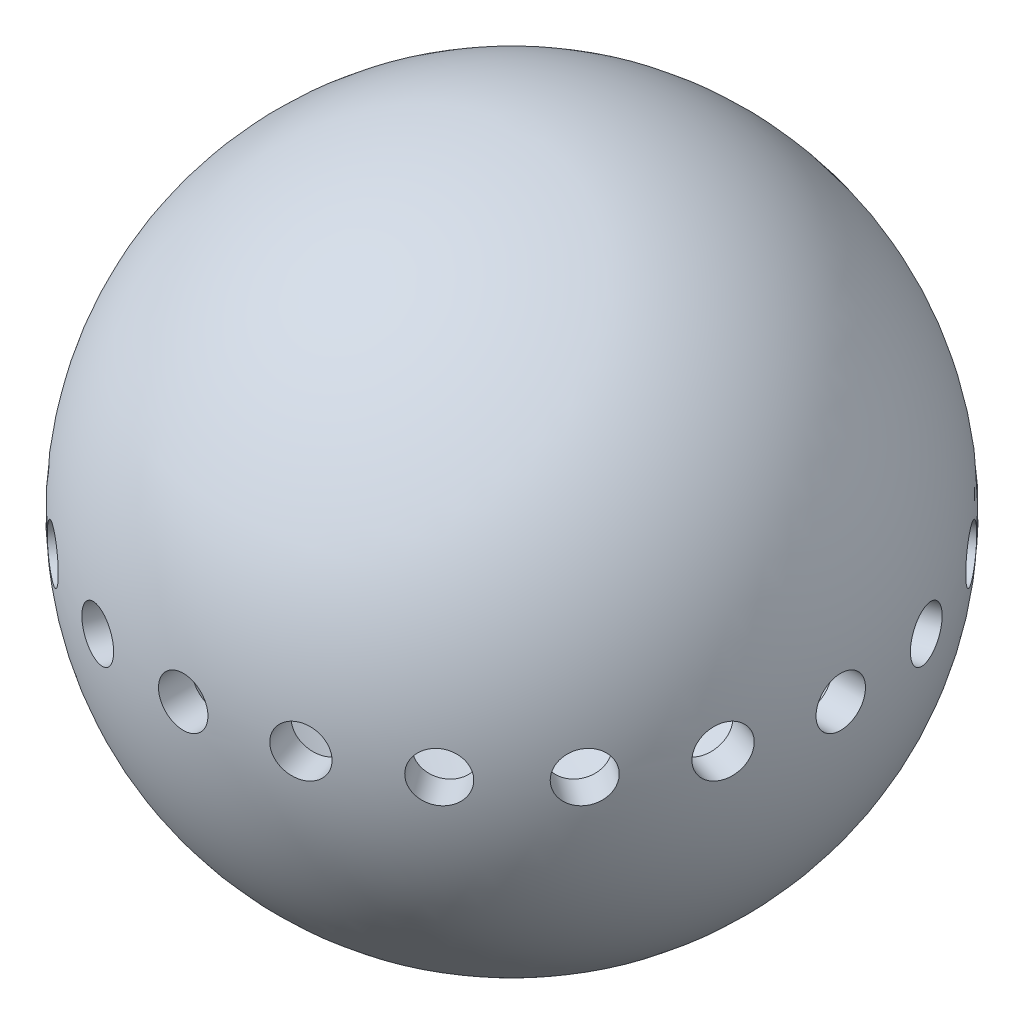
ISO-10303-21;
HEADER;
FILE_DESCRIPTION(('STEP AP214'),'2;1');
FILE_NAME('part.step','',(''),(''),'','','');
FILE_SCHEMA(('AUTOMOTIVE_DESIGN { 1 0 10303 214 1 1 1 1 }'));
ENDSEC;
DATA;
#1=APPLICATION_CONTEXT('core data for automotive mechanical design processes');
#2=APPLICATION_PROTOCOL_DEFINITION('international standard','automotive_design',2000,#1);
#3=PRODUCT_CONTEXT('',#1,'mechanical');
#4=PRODUCT('Part','Part','',(#3));
#5=PRODUCT_RELATED_PRODUCT_CATEGORY('part','',(#4));
#6=PRODUCT_DEFINITION_FORMATION('','',#4);
#7=PRODUCT_DEFINITION_CONTEXT('part definition',#1,'design');
#8=PRODUCT_DEFINITION('design','',#6,#7);
#9=PRODUCT_DEFINITION_SHAPE('','',#8);
#10=(LENGTH_UNIT() NAMED_UNIT(*) SI_UNIT(.MILLI.,.METRE.));
#11=(NAMED_UNIT(*) PLANE_ANGLE_UNIT() SI_UNIT($,.RADIAN.));
#12=(NAMED_UNIT(*) SI_UNIT($,.STERADIAN.) SOLID_ANGLE_UNIT());
#13=UNCERTAINTY_MEASURE_WITH_UNIT(LENGTH_MEASURE(1.E-05),#10,'distance_accuracy_value','');
#14=(GEOMETRIC_REPRESENTATION_CONTEXT(3) GLOBAL_UNCERTAINTY_ASSIGNED_CONTEXT((#13)) GLOBAL_UNIT_ASSIGNED_CONTEXT((#10,
#11,#12)) REPRESENTATION_CONTEXT('',''));
#15=CARTESIAN_POINT('',(0.,0.,0.));
#16=DIRECTION('',(0.,0.,1.));
#17=DIRECTION('',(1.,0.,0.));
#18=AXIS2_PLACEMENT_3D('',#15,#16,#17);
#19=CARTESIAN_POINT('',(0.,0.,0.));
#20=DIRECTION('',(0.,1.,0.));
#21=DIRECTION('',(-1.,0.,0.));
#22=AXIS2_PLACEMENT_3D('',#19,#20,#21);
#23=SPHERICAL_SURFACE('',#22,18.);
#24=CARTESIAN_POINT('',(0.,0.,17.9373911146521));
#25=DIRECTION('',(0.,0.,-1.));
#26=DIRECTION('',(-1.,0.,0.));
#27=AXIS2_PLACEMENT_3D('',#24,#25,#26);
#28=CIRCLE('',#27,1.5);
#29=CARTESIAN_POINT('',(-1.5,0.,17.9373911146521));
#30=VERTEX_POINT('',#29);
#31=EDGE_CURVE('E38',#30,#30,#28,.T.);
#32=ORIENTED_EDGE('',*,*,#31,.F.);
#33=EDGE_LOOP('',(#32));
#34=FACE_BOUND('',#33,.T.);
#35=CARTESIAN_POINT('',(-5.54295868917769,0.,17.0594727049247));
#36=DIRECTION('',(0.309016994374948,0.,-0.951056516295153));
#37=DIRECTION('',(-0.951056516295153,0.,-0.309016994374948));
#38=AXIS2_PLACEMENT_3D('',#35,#36,#37);
#39=CIRCLE('',#38,1.5);
#40=CARTESIAN_POINT('',(-6.96954346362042,0.,16.5959472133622));
#41=VERTEX_POINT('',#40);
#42=EDGE_CURVE('E51',#41,#41,#39,.T.);
#43=ORIENTED_EDGE('',*,*,#42,.F.);
#44=EDGE_LOOP('',(#43));
#45=FACE_BOUND('',#44,.T.);
#46=CARTESIAN_POINT('',(10.5433339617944,0.,14.5116542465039));
#47=DIRECTION('',(-0.587785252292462,0.,-0.809016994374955));
#48=DIRECTION('',(-0.809016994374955,0.,0.587785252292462));
#49=AXIS2_PLACEMENT_3D('',#46,#47,#48);
#50=CIRCLE('',#49,1.5);
#51=CARTESIAN_POINT('',(9.32980847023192,0.,15.3933321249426));
#52=VERTEX_POINT('',#51);
#53=EDGE_CURVE('E55',#52,#52,#50,.T.);
#54=ORIENTED_EDGE('',*,*,#53,.F.);
#55=EDGE_LOOP('',(#54));
#56=FACE_BOUND('',#55,.T.);
#57=CARTESIAN_POINT('',(5.54295868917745,0.,17.0594727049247));
#58=DIRECTION('',(-0.309016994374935,0.,-0.951056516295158));
#59=DIRECTION('',(-0.951056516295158,0.,0.309016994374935));
#60=AXIS2_PLACEMENT_3D('',#57,#58,#59);
#61=CIRCLE('',#60,1.5);
#62=CARTESIAN_POINT('',(4.11637391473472,0.,17.5229981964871));
#63=VERTEX_POINT('',#62);
#64=EDGE_CURVE('E59',#63,#63,#61,.T.);
#65=ORIENTED_EDGE('',*,*,#64,.F.);
#66=EDGE_LOOP('',(#65));
#67=FACE_BOUND('',#66,.T.);
#68=CARTESIAN_POINT('',(10.5433339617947,0.,-14.5116542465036));
#69=DIRECTION('',(-0.58778525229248,0.,0.809016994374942));
#70=DIRECTION('',(0.809016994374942,0.,0.58778525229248));
#71=AXIS2_PLACEMENT_3D('',#68,#69,#70);
#72=CIRCLE('',#71,1.5);
#73=CARTESIAN_POINT('',(11.7568594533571,0.,-13.6299763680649));
#74=VERTEX_POINT('',#73);
#75=EDGE_CURVE('E63',#74,#74,#72,.T.);
#76=ORIENTED_EDGE('',*,*,#75,.F.);
#77=EDGE_LOOP('',(#76));
#78=FACE_BOUND('',#77,.T.);
#79=CARTESIAN_POINT('',(14.5116542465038,0.,-10.5433339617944));
#80=DIRECTION('',(-0.809016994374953,0.,0.587785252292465));
#81=DIRECTION('',(0.587785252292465,0.,0.809016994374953));
#82=AXIS2_PLACEMENT_3D('',#79,#80,#81);
#83=CIRCLE('',#82,1.5);
#84=CARTESIAN_POINT('',(15.3933321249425,0.,-9.32980847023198));
#85=VERTEX_POINT('',#84);
#86=EDGE_CURVE('E67',#85,#85,#83,.T.);
#87=ORIENTED_EDGE('',*,*,#86,.F.);
#88=EDGE_LOOP('',(#87));
#89=FACE_BOUND('',#88,.T.);
#90=CARTESIAN_POINT('',(5.54295868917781,0.,-17.0594727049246));
#91=DIRECTION('',(-0.309016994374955,0.,0.951056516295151));
#92=DIRECTION('',(0.951056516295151,0.,0.309016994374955));
#93=AXIS2_PLACEMENT_3D('',#90,#91,#92);
#94=CIRCLE('',#93,1.5);
#95=CARTESIAN_POINT('',(6.96954346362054,0.,-16.5959472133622));
#96=VERTEX_POINT('',#95);
#97=EDGE_CURVE('E71',#96,#96,#94,.T.);
#98=ORIENTED_EDGE('',*,*,#97,.F.);
#99=EDGE_LOOP('',(#98));
#100=FACE_BOUND('',#99,.T.);
#101=CARTESIAN_POINT('',(0.,0.,-17.9373911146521));
#102=DIRECTION('',(0.,0.,1.));
#103=DIRECTION('',(1.,0.,0.));
#104=AXIS2_PLACEMENT_3D('',#101,#102,#103);
#105=CIRCLE('',#104,1.5);
#106=CARTESIAN_POINT('',(1.5,0.,-17.9373911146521));
#107=VERTEX_POINT('',#106);
#108=EDGE_CURVE('E75',#107,#107,#105,.T.);
#109=ORIENTED_EDGE('',*,*,#108,.F.);
#110=EDGE_LOOP('',(#109));
#111=FACE_BOUND('',#110,.T.);
#112=CARTESIAN_POINT('',(17.0594727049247,0.,-5.54295868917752));
#113=DIRECTION('',(-0.951056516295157,0.,0.309016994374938));
#114=DIRECTION('',(0.309016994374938,0.,0.951056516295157));
#115=AXIS2_PLACEMENT_3D('',#112,#113,#114);
#116=CIRCLE('',#115,1.5);
#117=CARTESIAN_POINT('',(17.5229981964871,0.,-4.11637391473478));
#118=VERTEX_POINT('',#117);
#119=EDGE_CURVE('E79',#118,#118,#116,.T.);
#120=ORIENTED_EDGE('',*,*,#119,.F.);
#121=EDGE_LOOP('',(#120));
#122=FACE_BOUND('',#121,.T.);
#123=CARTESIAN_POINT('',(17.9373911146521,0.,1.87884199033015E-13));
#124=DIRECTION('',(-1.,0.,0.));
#125=DIRECTION('',(0.,0.,1.));
#126=AXIS2_PLACEMENT_3D('',#123,#124,#125);
#127=CIRCLE('',#126,1.5);
#128=CARTESIAN_POINT('',(17.9373911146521,0.,1.50000000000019));
#129=VERTEX_POINT('',#128);
#130=EDGE_CURVE('E83',#129,#129,#127,.T.);
#131=ORIENTED_EDGE('',*,*,#130,.F.);
#132=EDGE_LOOP('',(#131));
#133=FACE_BOUND('',#132,.T.);
#134=CARTESIAN_POINT('',(14.5116542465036,0.,10.5433339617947));
#135=DIRECTION('',(-0.80901699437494,0.,-0.587785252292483));
#136=DIRECTION('',(-0.587785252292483,0.,0.80901699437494));
#137=AXIS2_PLACEMENT_3D('',#134,#135,#136);
#138=CIRCLE('',#137,1.5);
#139=CARTESIAN_POINT('',(13.6299763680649,0.,11.7568594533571));
#140=VERTEX_POINT('',#139);
#141=EDGE_CURVE('E87',#140,#140,#138,.T.);
#142=ORIENTED_EDGE('',*,*,#141,.F.);
#143=EDGE_LOOP('',(#142));
#144=FACE_BOUND('',#143,.T.);
#145=CARTESIAN_POINT('',(17.0594727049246,0.,5.54295868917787));
#146=DIRECTION('',(-0.95105651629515,0.,-0.309016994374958));
#147=DIRECTION('',(-0.309016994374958,0.,0.95105651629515));
#148=AXIS2_PLACEMENT_3D('',#145,#146,#147);
#149=CIRCLE('',#148,1.5);
#150=CARTESIAN_POINT('',(16.5959472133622,0.,6.9695434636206));
#151=VERTEX_POINT('',#150);
#152=EDGE_CURVE('E91',#151,#151,#149,.T.);
#153=ORIENTED_EDGE('',*,*,#152,.F.);
#154=EDGE_LOOP('',(#153));
#155=FACE_BOUND('',#154,.T.);
#156=CARTESIAN_POINT('',(-14.5116542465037,0.,-10.5433339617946));
#157=DIRECTION('',(0.809016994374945,0.,0.587785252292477));
#158=DIRECTION('',(0.587785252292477,0.,-0.809016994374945));
#159=AXIS2_PLACEMENT_3D('',#156,#157,#158);
#160=CIRCLE('',#159,1.5);
#161=CARTESIAN_POINT('',(-13.629976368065,0.,-11.756859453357));
#162=VERTEX_POINT('',#161);
#163=EDGE_CURVE('E95',#162,#162,#160,.T.);
#164=ORIENTED_EDGE('',*,*,#163,.F.);
#165=EDGE_LOOP('',(#164));
#166=FACE_BOUND('',#165,.T.);
#167=CARTESIAN_POINT('',(-17.0594727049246,0.,-5.54295868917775));
#168=DIRECTION('',(0.951056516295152,0.,0.309016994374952));
#169=DIRECTION('',(0.309016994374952,0.,-0.951056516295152));
#170=AXIS2_PLACEMENT_3D('',#167,#168,#169);
#171=CIRCLE('',#170,1.5);
#172=CARTESIAN_POINT('',(-16.5959472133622,0.,-6.96954346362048));
#173=VERTEX_POINT('',#172);
#174=EDGE_CURVE('E99',#173,#173,#171,.T.);
#175=ORIENTED_EDGE('',*,*,#174,.F.);
#176=EDGE_LOOP('',(#175));
#177=FACE_BOUND('',#176,.T.);
#178=CARTESIAN_POINT('',(-5.54295868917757,0.,-17.0594727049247));
#179=DIRECTION('',(0.309016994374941,0.,0.951056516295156));
#180=DIRECTION('',(0.951056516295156,0.,-0.309016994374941));
#181=AXIS2_PLACEMENT_3D('',#178,#179,#180);
#182=CIRCLE('',#181,1.5);
#183=CARTESIAN_POINT('',(-4.11637391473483,0.,-17.5229981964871));
#184=VERTEX_POINT('',#183);
#185=EDGE_CURVE('E103',#184,#184,#182,.T.);
#186=ORIENTED_EDGE('',*,*,#185,.F.);
#187=EDGE_LOOP('',(#186));
#188=FACE_BOUND('',#187,.T.);
#189=CARTESIAN_POINT('',(-10.5433339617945,0.,-14.5116542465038));
#190=DIRECTION('',(0.587785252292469,0.,0.809016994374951));
#191=DIRECTION('',(0.809016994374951,0.,-0.587785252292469));
#192=AXIS2_PLACEMENT_3D('',#189,#190,#191);
#193=CIRCLE('',#192,1.5);
#194=CARTESIAN_POINT('',(-9.32980847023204,0.,-15.3933321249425));
#195=VERTEX_POINT('',#194);
#196=EDGE_CURVE('E107',#195,#195,#193,.T.);
#197=ORIENTED_EDGE('',*,*,#196,.F.);
#198=EDGE_LOOP('',(#197));
#199=FACE_BOUND('',#198,.T.);
#200=CARTESIAN_POINT('',(-14.5116542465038,0.,10.5433339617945));
#201=DIRECTION('',(0.809016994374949,0.,-0.587785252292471));
#202=DIRECTION('',(-0.587785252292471,0.,-0.809016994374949));
#203=AXIS2_PLACEMENT_3D('',#200,#201,#202);
#204=CIRCLE('',#203,1.5);
#205=CARTESIAN_POINT('',(-15.3933321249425,0.,9.32980847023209));
#206=VERTEX_POINT('',#205);
#207=EDGE_CURVE('E111',#206,#206,#204,.T.);
#208=ORIENTED_EDGE('',*,*,#207,.F.);
#209=EDGE_LOOP('',(#208));
#210=FACE_BOUND('',#209,.T.);
#211=CARTESIAN_POINT('',(-10.5433339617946,0.,14.5116542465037));
#212=DIRECTION('',(0.587785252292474,0.,-0.809016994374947));
#213=DIRECTION('',(-0.809016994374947,0.,-0.587785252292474));
#214=AXIS2_PLACEMENT_3D('',#211,#212,#213);
#215=CIRCLE('',#214,1.5);
#216=CARTESIAN_POINT('',(-11.756859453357,0.,13.629976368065));
#217=VERTEX_POINT('',#216);
#218=EDGE_CURVE('E114',#217,#217,#215,.T.);
#219=ORIENTED_EDGE('',*,*,#218,.F.);
#220=EDGE_LOOP('',(#219));
#221=FACE_BOUND('',#220,.T.);
#222=CARTESIAN_POINT('',(-17.0594727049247,0.,5.54295868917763));
#223=DIRECTION('',(0.951056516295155,0.,-0.309016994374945));
#224=DIRECTION('',(-0.309016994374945,0.,-0.951056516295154));
#225=AXIS2_PLACEMENT_3D('',#222,#223,#224);
#226=CIRCLE('',#225,1.5);
#227=CARTESIAN_POINT('',(-17.5229981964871,0.,4.1163739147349));
#228=VERTEX_POINT('',#227);
#229=EDGE_CURVE('E117',#228,#228,#226,.T.);
#230=ORIENTED_EDGE('',*,*,#229,.F.);
#231=EDGE_LOOP('',(#230));
#232=FACE_BOUND('',#231,.T.);
#233=CARTESIAN_POINT('',(-17.9373911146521,0.,0.));
#234=DIRECTION('',(1.,0.,0.));
#235=DIRECTION('',(0.,0.,-1.));
#236=AXIS2_PLACEMENT_3D('',#233,#234,#235);
#237=CIRCLE('',#236,1.5);
#238=CARTESIAN_POINT('',(-17.9373911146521,0.,-1.50000000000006));
#239=VERTEX_POINT('',#238);
#240=EDGE_CURVE('E43',#239,#239,#237,.T.);
#241=ORIENTED_EDGE('',*,*,#240,.F.);
#242=EDGE_LOOP('',(#241));
#243=FACE_BOUND('',#242,.T.);
#244=ADVANCED_FACE('F31',(#34,#45,#56,#67,#78,#89,#100,#111,#122,#133,#144,#155,#166,#177,#188,
#199,#210,#221,#232,#243),#23,.F.);
#245=CARTESIAN_POINT('',(0.,0.,0.));
#246=DIRECTION('',(0.,1.,0.));
#247=DIRECTION('',(1.,0.,0.));
#248=AXIS2_PLACEMENT_3D('',#245,#246,#247);
#249=SPHERICAL_SURFACE('',#248,20.);
#250=CARTESIAN_POINT('',(0.,0.,19.9436706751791));
#251=DIRECTION('',(0.,0.,-1.));
#252=DIRECTION('',(-1.,0.,0.));
#253=AXIS2_PLACEMENT_3D('',#250,#251,#252);
#254=CIRCLE('',#253,1.5);
#255=CARTESIAN_POINT('',(-1.5,0.,19.9436706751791));
#256=VERTEX_POINT('',#255);
#257=EDGE_CURVE('E10',#256,#256,#254,.F.);
#258=ORIENTED_EDGE('',*,*,#257,.F.);
#259=EDGE_LOOP('',(#258));
#260=FACE_BOUND('',#259,.T.);
#261=CARTESIAN_POINT('',(-6.16293316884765,0.,18.9675579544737));
#262=DIRECTION('',(0.309016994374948,0.,-0.951056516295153));
#263=DIRECTION('',(-0.951056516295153,0.,-0.309016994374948));
#264=AXIS2_PLACEMENT_3D('',#261,#262,#263);
#265=CIRCLE('',#264,1.5);
#266=CARTESIAN_POINT('',(-7.58951794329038,0.,18.5040324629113));
#267=VERTEX_POINT('',#266);
#268=EDGE_CURVE('E48',#267,#267,#265,.F.);
#269=ORIENTED_EDGE('',*,*,#268,.F.);
#270=EDGE_LOOP('',(#269));
#271=FACE_BOUND('',#270,.T.);
#272=CARTESIAN_POINT('',(11.7225954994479,0.,16.1347685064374));
#273=DIRECTION('',(-0.587785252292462,0.,-0.809016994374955));
#274=DIRECTION('',(-0.809016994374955,0.,0.587785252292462));
#275=AXIS2_PLACEMENT_3D('',#272,#273,#274);
#276=CIRCLE('',#275,1.5);
#277=CARTESIAN_POINT('',(10.5090700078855,0.,17.016446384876));
#278=VERTEX_POINT('',#277);
#279=EDGE_CURVE('E52',#278,#278,#276,.F.);
#280=ORIENTED_EDGE('',*,*,#279,.F.);
#281=EDGE_LOOP('',(#280));
#282=FACE_BOUND('',#281,.T.);
#283=CARTESIAN_POINT('',(6.16293316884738,0.,18.9675579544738));
#284=DIRECTION('',(-0.309016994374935,0.,-0.951056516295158));
#285=DIRECTION('',(-0.951056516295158,0.,0.309016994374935));
#286=AXIS2_PLACEMENT_3D('',#283,#284,#285);
#287=CIRCLE('',#286,1.5);
#288=CARTESIAN_POINT('',(4.73634839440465,0.,19.4310834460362));
#289=VERTEX_POINT('',#288);
#290=EDGE_CURVE('E56',#289,#289,#287,.F.);
#291=ORIENTED_EDGE('',*,*,#290,.F.);
#292=EDGE_LOOP('',(#291));
#293=FACE_BOUND('',#292,.T.);
#294=CARTESIAN_POINT('',(11.7225954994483,0.,-16.1347685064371));
#295=DIRECTION('',(-0.58778525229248,0.,0.809016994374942));
#296=DIRECTION('',(0.809016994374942,0.,0.58778525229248));
#297=AXIS2_PLACEMENT_3D('',#294,#295,#296);
#298=CIRCLE('',#297,1.5);
#299=CARTESIAN_POINT('',(12.9361209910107,0.,-15.2530906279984));
#300=VERTEX_POINT('',#299);
#301=EDGE_CURVE('E60',#300,#300,#298,.F.);
#302=ORIENTED_EDGE('',*,*,#301,.F.);
#303=EDGE_LOOP('',(#302));
#304=FACE_BOUND('',#303,.T.);
#305=CARTESIAN_POINT('',(16.1347685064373,0.,-11.722595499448));
#306=DIRECTION('',(-0.809016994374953,0.,0.587785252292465));
#307=DIRECTION('',(0.587785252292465,0.,0.809016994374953));
#308=AXIS2_PLACEMENT_3D('',#305,#306,#307);
#309=CIRCLE('',#308,1.5);
#310=CARTESIAN_POINT('',(17.016446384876,0.,-10.5090700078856));
#311=VERTEX_POINT('',#310);
#312=EDGE_CURVE('E64',#311,#311,#309,.F.);
#313=ORIENTED_EDGE('',*,*,#312,.F.);
#314=EDGE_LOOP('',(#313));
#315=FACE_BOUND('',#314,.T.);
#316=CARTESIAN_POINT('',(6.16293316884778,0.,-18.9675579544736));
#317=DIRECTION('',(-0.309016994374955,0.,0.951056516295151));
#318=DIRECTION('',(0.951056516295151,0.,0.309016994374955));
#319=AXIS2_PLACEMENT_3D('',#316,#317,#318);
#320=CIRCLE('',#319,1.5);
#321=CARTESIAN_POINT('',(7.58951794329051,0.,-18.5040324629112));
#322=VERTEX_POINT('',#321);
#323=EDGE_CURVE('E68',#322,#322,#320,.F.);
#324=ORIENTED_EDGE('',*,*,#323,.F.);
#325=EDGE_LOOP('',(#324));
#326=FACE_BOUND('',#325,.T.);
#327=CARTESIAN_POINT('',(0.,0.,-19.9436706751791));
#328=DIRECTION('',(0.,0.,1.));
#329=DIRECTION('',(1.,0.,0.));
#330=AXIS2_PLACEMENT_3D('',#327,#328,#329);
#331=CIRCLE('',#330,1.5);
#332=CARTESIAN_POINT('',(1.5,0.,-19.9436706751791));
#333=VERTEX_POINT('',#332);
#334=EDGE_CURVE('E72',#333,#333,#331,.F.);
#335=ORIENTED_EDGE('',*,*,#334,.F.);
#336=EDGE_LOOP('',(#335));
#337=FACE_BOUND('',#336,.T.);
#338=CARTESIAN_POINT('',(18.9675579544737,0.,-6.16293316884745));
#339=DIRECTION('',(-0.951056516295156,0.,0.309016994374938));
#340=DIRECTION('',(0.309016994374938,0.,0.951056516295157));
#341=AXIS2_PLACEMENT_3D('',#338,#339,#340);
#342=CIRCLE('',#341,1.5);
#343=CARTESIAN_POINT('',(19.4310834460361,0.,-4.73634839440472));
#344=VERTEX_POINT('',#343);
#345=EDGE_CURVE('E76',#344,#344,#342,.F.);
#346=ORIENTED_EDGE('',*,*,#345,.F.);
#347=EDGE_LOOP('',(#346));
#348=FACE_BOUND('',#347,.T.);
#349=CARTESIAN_POINT('',(19.9436706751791,0.,2.08898861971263E-13));
#350=DIRECTION('',(-1.,0.,0.));
#351=DIRECTION('',(0.,0.,1.));
#352=AXIS2_PLACEMENT_3D('',#349,#350,#351);
#353=CIRCLE('',#352,1.5);
#354=CARTESIAN_POINT('',(19.9436706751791,0.,1.50000000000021));
#355=VERTEX_POINT('',#354);
#356=EDGE_CURVE('E80',#355,#355,#353,.F.);
#357=ORIENTED_EDGE('',*,*,#356,.F.);
#358=EDGE_LOOP('',(#357));
#359=FACE_BOUND('',#358,.T.);
#360=CARTESIAN_POINT('',(16.1347685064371,0.,11.7225954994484));
#361=DIRECTION('',(-0.80901699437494,0.,-0.587785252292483));
#362=DIRECTION('',(-0.587785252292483,0.,0.80901699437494));
#363=AXIS2_PLACEMENT_3D('',#360,#361,#362);
#364=CIRCLE('',#363,1.5);
#365=CARTESIAN_POINT('',(15.2530906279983,0.,12.9361209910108));
#366=VERTEX_POINT('',#365);
#367=EDGE_CURVE('E84',#366,#366,#364,.F.);
#368=ORIENTED_EDGE('',*,*,#367,.F.);
#369=EDGE_LOOP('',(#368));
#370=FACE_BOUND('',#369,.T.);
#371=CARTESIAN_POINT('',(18.9675579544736,0.,6.16293316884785));
#372=DIRECTION('',(-0.95105651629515,0.,-0.309016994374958));
#373=DIRECTION('',(-0.309016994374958,0.,0.95105651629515));
#374=AXIS2_PLACEMENT_3D('',#371,#372,#373);
#375=CIRCLE('',#374,1.5);
#376=CARTESIAN_POINT('',(18.5040324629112,0.,7.58951794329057));
#377=VERTEX_POINT('',#376);
#378=EDGE_CURVE('E88',#377,#377,#375,.F.);
#379=ORIENTED_EDGE('',*,*,#378,.F.);
#380=EDGE_LOOP('',(#379));
#381=FACE_BOUND('',#380,.T.);
#382=CARTESIAN_POINT('',(-16.1347685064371,0.,-11.7225954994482));
#383=DIRECTION('',(0.809016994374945,0.,0.587785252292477));
#384=DIRECTION('',(0.587785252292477,0.,-0.809016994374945));
#385=AXIS2_PLACEMENT_3D('',#382,#383,#384);
#386=CIRCLE('',#385,1.5);
#387=CARTESIAN_POINT('',(-15.2530906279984,0.,-12.9361209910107));
#388=VERTEX_POINT('',#387);
#389=EDGE_CURVE('E92',#388,#388,#386,.F.);
#390=ORIENTED_EDGE('',*,*,#389,.F.);
#391=EDGE_LOOP('',(#390));
#392=FACE_BOUND('',#391,.T.);
#393=CARTESIAN_POINT('',(-18.9675579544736,0.,-6.16293316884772));
#394=DIRECTION('',(0.951056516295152,0.,0.309016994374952));
#395=DIRECTION('',(0.309016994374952,0.,-0.951056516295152));
#396=AXIS2_PLACEMENT_3D('',#393,#394,#395);
#397=CIRCLE('',#396,1.5);
#398=CARTESIAN_POINT('',(-18.5040324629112,0.,-7.58951794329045));
#399=VERTEX_POINT('',#398);
#400=EDGE_CURVE('E96',#399,#399,#397,.F.);
#401=ORIENTED_EDGE('',*,*,#400,.F.);
#402=EDGE_LOOP('',(#401));
#403=FACE_BOUND('',#402,.T.);
#404=CARTESIAN_POINT('',(-6.16293316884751,0.,-18.9675579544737));
#405=DIRECTION('',(0.309016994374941,0.,0.951056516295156));
#406=DIRECTION('',(0.951056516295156,0.,-0.309016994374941));
#407=AXIS2_PLACEMENT_3D('',#404,#405,#406);
#408=CIRCLE('',#407,1.5);
#409=CARTESIAN_POINT('',(-4.73634839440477,0.,-19.4310834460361));
#410=VERTEX_POINT('',#409);
#411=EDGE_CURVE('E100',#410,#410,#408,.F.);
#412=ORIENTED_EDGE('',*,*,#411,.F.);
#413=EDGE_LOOP('',(#412));
#414=FACE_BOUND('',#413,.T.);
#415=CARTESIAN_POINT('',(-11.7225954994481,0.,-16.1347685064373));
#416=DIRECTION('',(0.587785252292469,0.,0.809016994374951));
#417=DIRECTION('',(0.809016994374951,0.,-0.587785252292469));
#418=AXIS2_PLACEMENT_3D('',#415,#416,#417);
#419=CIRCLE('',#418,1.5);
#420=CARTESIAN_POINT('',(-10.5090700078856,0.,-17.016446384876));
#421=VERTEX_POINT('',#420);
#422=EDGE_CURVE('E104',#421,#421,#419,.F.);
#423=ORIENTED_EDGE('',*,*,#422,.F.);
#424=EDGE_LOOP('',(#423));
#425=FACE_BOUND('',#424,.T.);
#426=CARTESIAN_POINT('',(-16.1347685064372,0.,11.7225954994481));
#427=DIRECTION('',(0.809016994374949,0.,-0.587785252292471));
#428=DIRECTION('',(-0.587785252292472,0.,-0.809016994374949));
#429=AXIS2_PLACEMENT_3D('',#426,#427,#428);
#430=CIRCLE('',#429,1.5);
#431=CARTESIAN_POINT('',(-17.0164463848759,0.,10.5090700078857));
#432=VERTEX_POINT('',#431);
#433=EDGE_CURVE('E108',#432,#432,#430,.F.);
#434=ORIENTED_EDGE('',*,*,#433,.F.);
#435=EDGE_LOOP('',(#434));
#436=FACE_BOUND('',#435,.T.);
#437=CARTESIAN_POINT('',(-11.7225954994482,0.,16.1347685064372));
#438=DIRECTION('',(0.587785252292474,0.,-0.809016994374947));
#439=DIRECTION('',(-0.809016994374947,0.,-0.587785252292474));
#440=AXIS2_PLACEMENT_3D('',#437,#438,#439);
#441=CIRCLE('',#440,1.5);
#442=CARTESIAN_POINT('',(-12.9361209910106,0.,15.2530906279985));
#443=VERTEX_POINT('',#442);
#444=EDGE_CURVE('E112',#443,#443,#441,.F.);
#445=ORIENTED_EDGE('',*,*,#444,.F.);
#446=EDGE_LOOP('',(#445));
#447=FACE_BOUND('',#446,.T.);
#448=CARTESIAN_POINT('',(-18.9675579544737,0.,6.16293316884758));
#449=DIRECTION('',(0.951056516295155,0.,-0.309016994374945));
#450=DIRECTION('',(-0.309016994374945,0.,-0.951056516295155));
#451=AXIS2_PLACEMENT_3D('',#448,#449,#450);
#452=CIRCLE('',#451,1.5);
#453=CARTESIAN_POINT('',(-19.4310834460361,0.,4.73634839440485));
#454=VERTEX_POINT('',#453);
#455=EDGE_CURVE('E115',#454,#454,#452,.F.);
#456=ORIENTED_EDGE('',*,*,#455,.F.);
#457=EDGE_LOOP('',(#456));
#458=FACE_BOUND('',#457,.T.);
#459=CARTESIAN_POINT('',(-19.9436706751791,0.,0.));
#460=DIRECTION('',(1.,0.,0.));
#461=DIRECTION('',(0.,0.,-1.));
#462=AXIS2_PLACEMENT_3D('',#459,#460,#461);
#463=CIRCLE('',#462,1.5);
#464=CARTESIAN_POINT('',(-19.9436706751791,0.,-1.50000000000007));
#465=VERTEX_POINT('',#464);
#466=EDGE_CURVE('E34',#465,#465,#463,.F.);
#467=ORIENTED_EDGE('',*,*,#466,.F.);
#468=EDGE_LOOP('',(#467));
#469=FACE_BOUND('',#468,.T.);
#470=ADVANCED_FACE('F163',(#260,#271,#282,#293,#304,#315,#326,#337,#348,#359,#370,#381,#392,
#403,#414,#425,#436,#447,#458,#469),#249,.T.);
#471=CARTESIAN_POINT('',(0.,0.,27.));
#472=DIRECTION('',(0.,0.,-1.));
#473=DIRECTION('',(-1.,0.,0.));
#474=AXIS2_PLACEMENT_3D('',#471,#472,#473);
#475=CYLINDRICAL_SURFACE('',#474,1.5);
#476=ORIENTED_EDGE('',*,*,#31,.T.);
#477=EDGE_LOOP('',(#476));
#478=FACE_BOUND('',#477,.T.);
#479=ORIENTED_EDGE('',*,*,#257,.T.);
#480=EDGE_LOOP('',(#479));
#481=FACE_BOUND('',#480,.T.);
#482=ADVANCED_FACE('F207',(#478,#481),#475,.F.);
#483=CARTESIAN_POINT('',(-8.3434588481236,0.,25.6785259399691));
#484=DIRECTION('',(0.309016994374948,0.,-0.951056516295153));
#485=DIRECTION('',(-0.951056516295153,0.,-0.309016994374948));
#486=AXIS2_PLACEMENT_3D('',#483,#484,#485);
#487=CYLINDRICAL_SURFACE('',#486,1.5);
#488=CARTESIAN_POINT('',(-7.58951794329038,0.,18.5040324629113));
#489=CARTESIAN_POINT('',(-7.58305987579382,0.,18.4841565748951));
#490=CARTESIAN_POINT('',(-7.57660180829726,0.,18.464280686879));
#491=CARTESIAN_POINT('',(-7.56368567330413,0.,18.4245289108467));
#492=CARTESIAN_POINT('',(-7.55722760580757,0.,18.4046530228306));
#493=CARTESIAN_POINT('',(-7.54431147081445,0.,18.3649012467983));
#494=CARTESIAN_POINT('',(-7.53785340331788,0.,18.3450253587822));
#495=CARTESIAN_POINT('',(-7.52493726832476,0.,18.3052735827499));
#496=CARTESIAN_POINT('',(-7.5184792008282,0.,18.2853976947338));
#497=CARTESIAN_POINT('',(-7.50556306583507,0.,18.2456459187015));
#498=CARTESIAN_POINT('',(-7.49910499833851,0.,18.2257700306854));
#499=CARTESIAN_POINT('',(-7.48618886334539,0.,18.1860182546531));
#500=CARTESIAN_POINT('',(-7.47973079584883,0.,18.166142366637));
#501=CARTESIAN_POINT('',(-7.4668146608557,0.,18.1263905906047));
#502=CARTESIAN_POINT('',(-7.46035659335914,0.,18.1065147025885));
#503=CARTESIAN_POINT('',(-7.44744045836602,0.,18.0667629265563));
#504=CARTESIAN_POINT('',(-7.44098239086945,0.,18.0468870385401));
#505=CARTESIAN_POINT('',(-7.42806625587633,0.,18.0071352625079));
#506=CARTESIAN_POINT('',(-7.42160818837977,0.,17.9872593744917));
#507=CARTESIAN_POINT('',(-7.40869205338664,0.,17.9475075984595));
#508=CARTESIAN_POINT('',(-7.40223398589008,0.,17.9276317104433));
#509=CARTESIAN_POINT('',(-7.38931785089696,0.,17.8878799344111));
#510=CARTESIAN_POINT('',(-7.3828597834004,0.,17.8680040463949));
#511=CARTESIAN_POINT('',(-7.36994364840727,0.,17.8282522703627));
#512=CARTESIAN_POINT('',(-7.36348558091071,0.,17.8083763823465));
#513=CARTESIAN_POINT('',(-7.35056944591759,0.,17.7686246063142));
#514=CARTESIAN_POINT('',(-7.34411137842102,0.,17.7487487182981));
#515=CARTESIAN_POINT('',(-7.3311952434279,0.,17.7089969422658));
#516=CARTESIAN_POINT('',(-7.32473717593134,0.,17.6891210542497));
#517=CARTESIAN_POINT('',(-7.31182104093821,0.,17.6493692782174));
#518=CARTESIAN_POINT('',(-7.30536297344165,0.,17.6294933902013));
#519=CARTESIAN_POINT('',(-7.29244683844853,0.,17.589741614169));
#520=CARTESIAN_POINT('',(-7.28598877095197,0.,17.5698657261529));
#521=CARTESIAN_POINT('',(-7.27307263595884,0.,17.5301139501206));
#522=CARTESIAN_POINT('',(-7.26661456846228,0.,17.5102380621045));
#523=CARTESIAN_POINT('',(-7.25369843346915,0.,17.4704862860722));
#524=CARTESIAN_POINT('',(-7.24724036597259,0.,17.4506103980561));
#525=CARTESIAN_POINT('',(-7.23432423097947,0.,17.4108586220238));
#526=CARTESIAN_POINT('',(-7.22786616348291,0.,17.3909827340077));
#527=CARTESIAN_POINT('',(-7.21495002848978,0.,17.3512309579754));
#528=CARTESIAN_POINT('',(-7.20849196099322,0.,17.3313550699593));
#529=CARTESIAN_POINT('',(-7.1955758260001,0.,17.291603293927));
#530=CARTESIAN_POINT('',(-7.18911775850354,0.,17.2717274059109));
#531=CARTESIAN_POINT('',(-7.17620162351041,0.,17.2319756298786));
#532=CARTESIAN_POINT('',(-7.16974355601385,0.,17.2120997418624));
#533=CARTESIAN_POINT('',(-7.15682742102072,0.,17.1723479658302));
#534=CARTESIAN_POINT('',(-7.15036935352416,0.,17.152472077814));
#535=CARTESIAN_POINT('',(-7.13745321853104,0.,17.1127203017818));
#536=CARTESIAN_POINT('',(-7.13099515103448,0.,17.0928444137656));
#537=CARTESIAN_POINT('',(-7.11807901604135,0.,17.0530926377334));
#538=CARTESIAN_POINT('',(-7.11162094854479,0.,17.0332167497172));
#539=CARTESIAN_POINT('',(-7.09870481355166,0.,16.993464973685));
#540=CARTESIAN_POINT('',(-7.0922467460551,0.,16.9735890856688));
#541=CARTESIAN_POINT('',(-7.07933061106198,0.,16.9338373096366));
#542=CARTESIAN_POINT('',(-7.07287254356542,0.,16.9139614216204));
#543=CARTESIAN_POINT('',(-7.05995640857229,0.,16.8742096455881));
#544=CARTESIAN_POINT('',(-7.05349834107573,0.,16.854333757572));
#545=CARTESIAN_POINT('',(-7.04058220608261,0.,16.8145819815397));
#546=CARTESIAN_POINT('',(-7.03412413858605,0.,16.7947060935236));
#547=CARTESIAN_POINT('',(-7.02120800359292,0.,16.7549543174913));
#548=CARTESIAN_POINT('',(-7.01474993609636,0.,16.7350784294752));
#549=CARTESIAN_POINT('',(-7.00183380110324,0.,16.6953266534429));
#550=CARTESIAN_POINT('',(-6.99537573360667,0.,16.6754507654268));
#551=CARTESIAN_POINT('',(-6.98245959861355,0.,16.6356989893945));
#552=CARTESIAN_POINT('',(-6.97600153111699,0.,16.6158231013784));
#553=CARTESIAN_POINT('',(-6.96954346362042,0.,16.5959472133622));
#554=B_SPLINE_CURVE_WITH_KNOTS('',3,(#488,#489,#490,#491,#492,#493,#494,#495,#496,#497,#498,
#499,#500,#501,#502,#503,#504,#505,#506,#507,#508,#509,#510,#511,#512,#513,#514,#515,#516,#517,
#518,#519,#520,#521,#522,#523,#524,#525,#526,#527,#528,#529,#530,#531,#532,#533,#534,#535,#536,
#537,#538,#539,#540,#541,#542,#543,#544,#545,#546,#547,#548,#549,#550,#551,#552,#553),
.UNSPECIFIED.,.F.,.F.,(4,2,2,2,2,2,2,2,2,2,2,2,2,2,2,2,2,2,2,2,2,2,2,2,2,2,2,2,2,2,2,2,4),(0.,
0.0626962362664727,0.125392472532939,0.188088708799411,0.250784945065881,0.31348118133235,
0.376177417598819,0.438873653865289,0.501569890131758,0.564266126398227,0.626962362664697,
0.689658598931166,0.752354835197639,0.815051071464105,0.877747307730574,0.940443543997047,
1.00313978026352,1.06583601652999,1.12853225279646,1.19122848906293,1.2539247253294,
1.31662096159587,1.37931719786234,1.4420134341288,1.50470967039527,1.56740590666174,
1.63010214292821,1.69279837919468,1.75549461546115,1.81819085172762,1.88088708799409,
1.94358332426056,2.00627956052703),.UNSPECIFIED.);
#555=EDGE_CURVE('BSEAM159',#267,#41,#554,.T.);
#556=ORIENTED_EDGE('',*,*,#268,.T.);
#557=ORIENTED_EDGE('',*,*,#42,.T.);
#558=ORIENTED_EDGE('',*,*,#555,.T.);
#559=ORIENTED_EDGE('',*,*,#555,.F.);
#560=EDGE_LOOP('',(#556,#558,#557,#559));
#561=FACE_BOUND('',#560,.T.);
#562=ADVANCED_FACE('F159',(#561),#487,.F.);
#563=CARTESIAN_POINT('',(15.8702018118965,0.,21.8434588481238));
#564=DIRECTION('',(-0.587785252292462,0.,-0.809016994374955));
#565=DIRECTION('',(-0.809016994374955,0.,0.587785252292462));
#566=AXIS2_PLACEMENT_3D('',#563,#564,#565);
#567=CYLINDRICAL_SURFACE('',#566,1.5);
#568=ORIENTED_EDGE('',*,*,#279,.T.);
#569=EDGE_LOOP('',(#568));
#570=FACE_BOUND('',#569,.T.);
#571=ORIENTED_EDGE('',*,*,#53,.T.);
#572=EDGE_LOOP('',(#571));
#573=FACE_BOUND('',#572,.T.);
#574=ADVANCED_FACE('F218',(#570,#573),#567,.F.);
#575=CARTESIAN_POINT('',(8.34345884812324,0.,25.6785259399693));
#576=DIRECTION('',(-0.309016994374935,0.,-0.951056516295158));
#577=DIRECTION('',(-0.951056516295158,0.,0.309016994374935));
#578=AXIS2_PLACEMENT_3D('',#575,#576,#577);
#579=CYLINDRICAL_SURFACE('',#578,1.5);
#580=ORIENTED_EDGE('',*,*,#290,.T.);
#581=EDGE_LOOP('',(#580));
#582=FACE_BOUND('',#581,.T.);
#583=ORIENTED_EDGE('',*,*,#64,.T.);
#584=EDGE_LOOP('',(#583));
#585=FACE_BOUND('',#584,.T.);
#586=ADVANCED_FACE('F233',(#582,#585),#579,.F.);
#587=CARTESIAN_POINT('',(15.870201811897,0.,-21.8434588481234));
#588=DIRECTION('',(-0.58778525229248,0.,0.809016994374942));
#589=DIRECTION('',(0.809016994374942,0.,0.58778525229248));
#590=AXIS2_PLACEMENT_3D('',#587,#588,#589);
#591=CYLINDRICAL_SURFACE('',#590,1.5);
#592=ORIENTED_EDGE('',*,*,#301,.T.);
#593=EDGE_LOOP('',(#592));
#594=FACE_BOUND('',#593,.T.);
#595=ORIENTED_EDGE('',*,*,#75,.T.);
#596=EDGE_LOOP('',(#595));
#597=FACE_BOUND('',#596,.T.);
#598=ADVANCED_FACE('F230',(#594,#597),#591,.F.);
#599=CARTESIAN_POINT('',(21.8434588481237,0.,-15.8702018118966));
#600=DIRECTION('',(-0.809016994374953,0.,0.587785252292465));
#601=DIRECTION('',(0.587785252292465,0.,0.809016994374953));
#602=AXIS2_PLACEMENT_3D('',#599,#600,#601);
#603=CYLINDRICAL_SURFACE('',#602,1.5);
#604=ORIENTED_EDGE('',*,*,#312,.T.);
#605=EDGE_LOOP('',(#604));
#606=FACE_BOUND('',#605,.T.);
#607=ORIENTED_EDGE('',*,*,#86,.T.);
#608=EDGE_LOOP('',(#607));
#609=FACE_BOUND('',#608,.T.);
#610=ADVANCED_FACE('F224',(#606,#609),#603,.F.);
#611=CARTESIAN_POINT('',(8.34345884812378,0.,-25.6785259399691));
#612=DIRECTION('',(-0.309016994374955,0.,0.951056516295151));
#613=DIRECTION('',(0.951056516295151,0.,0.309016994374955));
#614=AXIS2_PLACEMENT_3D('',#611,#612,#613);
#615=CYLINDRICAL_SURFACE('',#614,1.5);
#616=ORIENTED_EDGE('',*,*,#323,.T.);
#617=EDGE_LOOP('',(#616));
#618=FACE_BOUND('',#617,.T.);
#619=ORIENTED_EDGE('',*,*,#97,.T.);
#620=EDGE_LOOP('',(#619));
#621=FACE_BOUND('',#620,.T.);
#622=ADVANCED_FACE('F220',(#618,#621),#615,.F.);
#623=CARTESIAN_POINT('',(0.,0.,-27.));
#624=DIRECTION('',(0.,0.,1.));
#625=DIRECTION('',(1.,0.,0.));
#626=AXIS2_PLACEMENT_3D('',#623,#624,#625);
#627=CYLINDRICAL_SURFACE('',#626,1.5);
#628=ORIENTED_EDGE('',*,*,#334,.T.);
#629=EDGE_LOOP('',(#628));
#630=FACE_BOUND('',#629,.T.);
#631=ORIENTED_EDGE('',*,*,#108,.T.);
#632=EDGE_LOOP('',(#631));
#633=FACE_BOUND('',#632,.T.);
#634=ADVANCED_FACE('F223',(#630,#633),#627,.F.);
#635=CARTESIAN_POINT('',(25.6785259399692,0.,-8.34345884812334));
#636=DIRECTION('',(-0.951056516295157,0.,0.309016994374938));
#637=DIRECTION('',(0.309016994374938,0.,0.951056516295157));
#638=AXIS2_PLACEMENT_3D('',#635,#636,#637);
#639=CYLINDRICAL_SURFACE('',#638,1.5);
#640=ORIENTED_EDGE('',*,*,#345,.T.);
#641=EDGE_LOOP('',(#640));
#642=FACE_BOUND('',#641,.T.);
#643=ORIENTED_EDGE('',*,*,#119,.T.);
#644=EDGE_LOOP('',(#643));
#645=FACE_BOUND('',#644,.T.);
#646=ADVANCED_FACE('F228',(#642,#645),#639,.F.);
#647=CARTESIAN_POINT('',(27.,0.,2.82809988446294E-13));
#648=DIRECTION('',(-1.,0.,0.));
#649=DIRECTION('',(0.,0.,1.));
#650=AXIS2_PLACEMENT_3D('',#647,#648,#649);
#651=CYLINDRICAL_SURFACE('',#650,1.5);
#652=ORIENTED_EDGE('',*,*,#356,.T.);
#653=EDGE_LOOP('',(#652));
#654=FACE_BOUND('',#653,.T.);
#655=ORIENTED_EDGE('',*,*,#130,.T.);
#656=EDGE_LOOP('',(#655));
#657=FACE_BOUND('',#656,.T.);
#658=ADVANCED_FACE('F246',(#654,#657),#651,.F.);
#659=CARTESIAN_POINT('',(21.8434588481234,0.,15.870201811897));
#660=DIRECTION('',(-0.80901699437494,0.,-0.587785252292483));
#661=DIRECTION('',(-0.587785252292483,0.,0.80901699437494));
#662=AXIS2_PLACEMENT_3D('',#659,#660,#661);
#663=CYLINDRICAL_SURFACE('',#662,1.5);
#664=ORIENTED_EDGE('',*,*,#367,.T.);
#665=EDGE_LOOP('',(#664));
#666=FACE_BOUND('',#665,.T.);
#667=ORIENTED_EDGE('',*,*,#141,.T.);
#668=EDGE_LOOP('',(#667));
#669=FACE_BOUND('',#668,.T.);
#670=ADVANCED_FACE('F242',(#666,#669),#663,.F.);
#671=CARTESIAN_POINT('',(25.6785259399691,0.,8.34345884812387));
#672=DIRECTION('',(-0.95105651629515,0.,-0.309016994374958));
#673=DIRECTION('',(-0.309016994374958,0.,0.95105651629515));
#674=AXIS2_PLACEMENT_3D('',#671,#672,#673);
#675=CYLINDRICAL_SURFACE('',#674,1.5);
#676=ORIENTED_EDGE('',*,*,#378,.T.);
#677=EDGE_LOOP('',(#676));
#678=FACE_BOUND('',#677,.T.);
#679=ORIENTED_EDGE('',*,*,#152,.T.);
#680=EDGE_LOOP('',(#679));
#681=FACE_BOUND('',#680,.T.);
#682=ADVANCED_FACE('F238',(#678,#681),#675,.F.);
#683=CARTESIAN_POINT('',(-21.8434588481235,0.,-15.8702018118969));
#684=DIRECTION('',(0.809016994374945,0.,0.587785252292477));
#685=DIRECTION('',(0.587785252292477,0.,-0.809016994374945));
#686=AXIS2_PLACEMENT_3D('',#683,#684,#685);
#687=CYLINDRICAL_SURFACE('',#686,1.5);
#688=ORIENTED_EDGE('',*,*,#389,.T.);
#689=EDGE_LOOP('',(#688));
#690=FACE_BOUND('',#689,.T.);
#691=ORIENTED_EDGE('',*,*,#163,.T.);
#692=EDGE_LOOP('',(#691));
#693=FACE_BOUND('',#692,.T.);
#694=ADVANCED_FACE('F241',(#690,#693),#687,.F.);
#695=CARTESIAN_POINT('',(-25.6785259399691,0.,-8.34345884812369));
#696=DIRECTION('',(0.951056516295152,0.,0.309016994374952));
#697=DIRECTION('',(0.309016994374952,0.,-0.951056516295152));
#698=AXIS2_PLACEMENT_3D('',#695,#696,#697);
#699=CYLINDRICAL_SURFACE('',#698,1.5);
#700=ORIENTED_EDGE('',*,*,#400,.T.);
#701=EDGE_LOOP('',(#700));
#702=FACE_BOUND('',#701,.T.);
#703=ORIENTED_EDGE('',*,*,#174,.T.);
#704=EDGE_LOOP('',(#703));
#705=FACE_BOUND('',#704,.T.);
#706=ADVANCED_FACE('F254',(#702,#705),#699,.F.);
#707=CARTESIAN_POINT('',(-8.34345884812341,0.,-25.6785259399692));
#708=DIRECTION('',(0.309016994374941,0.,0.951056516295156));
#709=DIRECTION('',(0.951056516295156,0.,-0.309016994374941));
#710=AXIS2_PLACEMENT_3D('',#707,#708,#709);
#711=CYLINDRICAL_SURFACE('',#710,1.5);
#712=ORIENTED_EDGE('',*,*,#411,.T.);
#713=EDGE_LOOP('',(#712));
#714=FACE_BOUND('',#713,.T.);
#715=ORIENTED_EDGE('',*,*,#185,.T.);
#716=EDGE_LOOP('',(#715));
#717=FACE_BOUND('',#716,.T.);
#718=ADVANCED_FACE('F257',(#714,#717),#711,.F.);
#719=CARTESIAN_POINT('',(-15.8702018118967,0.,-21.8434588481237));
#720=DIRECTION('',(0.587785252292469,0.,0.809016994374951));
#721=DIRECTION('',(0.809016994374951,0.,-0.587785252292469));
#722=AXIS2_PLACEMENT_3D('',#719,#720,#721);
#723=CYLINDRICAL_SURFACE('',#722,1.5);
#724=ORIENTED_EDGE('',*,*,#422,.T.);
#725=EDGE_LOOP('',(#724));
#726=FACE_BOUND('',#725,.T.);
#727=ORIENTED_EDGE('',*,*,#196,.T.);
#728=EDGE_LOOP('',(#727));
#729=FACE_BOUND('',#728,.T.);
#730=ADVANCED_FACE('F262',(#726,#729),#723,.F.);
#731=CARTESIAN_POINT('',(-21.8434588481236,0.,15.8702018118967));
#732=DIRECTION('',(0.809016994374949,0.,-0.587785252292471));
#733=DIRECTION('',(-0.587785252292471,0.,-0.809016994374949));
#734=AXIS2_PLACEMENT_3D('',#731,#732,#733);
#735=CYLINDRICAL_SURFACE('',#734,1.5);
#736=ORIENTED_EDGE('',*,*,#433,.T.);
#737=EDGE_LOOP('',(#736));
#738=FACE_BOUND('',#737,.T.);
#739=ORIENTED_EDGE('',*,*,#207,.T.);
#740=EDGE_LOOP('',(#739));
#741=FACE_BOUND('',#740,.T.);
#742=ADVANCED_FACE('F265',(#738,#741),#735,.F.);
#743=CARTESIAN_POINT('',(-15.8702018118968,0.,21.8434588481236));
#744=DIRECTION('',(0.587785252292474,0.,-0.809016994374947));
#745=DIRECTION('',(-0.809016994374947,0.,-0.587785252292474));
#746=AXIS2_PLACEMENT_3D('',#743,#744,#745);
#747=CYLINDRICAL_SURFACE('',#746,1.5);
#748=CARTESIAN_POINT('',(-12.9361209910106,0.,15.2530906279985));
#749=CARTESIAN_POINT('',(-12.9238370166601,0.,15.2361831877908));
#750=CARTESIAN_POINT('',(-12.9115530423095,0.,15.2192757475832));
#751=CARTESIAN_POINT('',(-12.8869850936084,0.,15.1854608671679));
#752=CARTESIAN_POINT('',(-12.8747011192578,0.,15.1685534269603));
#753=CARTESIAN_POINT('',(-12.8501331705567,0.,15.134738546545));
#754=CARTESIAN_POINT('',(-12.8378491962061,0.,15.1178311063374));
#755=CARTESIAN_POINT('',(-12.813281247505,0.,15.0840162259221));
#756=CARTESIAN_POINT('',(-12.8009972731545,0.,15.0671087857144));
#757=CARTESIAN_POINT('',(-12.7764293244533,0.,15.0332939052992));
#758=CARTESIAN_POINT('',(-12.7641453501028,0.,15.0163864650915));
#759=CARTESIAN_POINT('',(-12.7395774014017,0.,14.9825715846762));
#760=CARTESIAN_POINT('',(-12.7272934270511,0.,14.9656641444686));
#761=CARTESIAN_POINT('',(-12.70272547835,0.,14.9318492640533));
#762=CARTESIAN_POINT('',(-12.6904415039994,0.,14.9149418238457));
#763=CARTESIAN_POINT('',(-12.6658735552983,0.,14.8811269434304));
#764=CARTESIAN_POINT('',(-12.6535895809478,0.,14.8642195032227));
#765=CARTESIAN_POINT('',(-12.6290216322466,0.,14.8304046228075));
#766=CARTESIAN_POINT('',(-12.6167376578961,0.,14.8134971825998));
#767=CARTESIAN_POINT('',(-12.592169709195,0.,14.7796823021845));
#768=CARTESIAN_POINT('',(-12.5798857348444,0.,14.7627748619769));
#769=CARTESIAN_POINT('',(-12.5553177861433,0.,14.7289599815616));
#770=CARTESIAN_POINT('',(-12.5430338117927,0.,14.712052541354));
#771=CARTESIAN_POINT('',(-12.5184658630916,0.,14.6782376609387));
#772=CARTESIAN_POINT('',(-12.5061818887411,0.,14.6613302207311));
#773=CARTESIAN_POINT('',(-12.4816139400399,0.,14.6275153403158));
#774=CARTESIAN_POINT('',(-12.4693299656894,0.,14.6106079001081));
#775=CARTESIAN_POINT('',(-12.4447620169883,0.,14.5767930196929));
#776=CARTESIAN_POINT('',(-12.4324780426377,0.,14.5598855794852));
#777=CARTESIAN_POINT('',(-12.4079100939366,0.,14.5260706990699));
#778=CARTESIAN_POINT('',(-12.395626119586,0.,14.5091632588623));
#779=CARTESIAN_POINT('',(-12.3710581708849,0.,14.475348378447));
#780=CARTESIAN_POINT('',(-12.3587741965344,0.,14.4584409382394));
#781=CARTESIAN_POINT('',(-12.3342062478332,0.,14.4246260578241));
#782=CARTESIAN_POINT('',(-12.3219222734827,0.,14.4077186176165));
#783=CARTESIAN_POINT('',(-12.2973543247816,0.,14.3739037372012));
#784=CARTESIAN_POINT('',(-12.285070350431,0.,14.3569962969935));
#785=CARTESIAN_POINT('',(-12.2605024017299,0.,14.3231814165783));
#786=CARTESIAN_POINT('',(-12.2482184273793,0.,14.3062739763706));
#787=CARTESIAN_POINT('',(-12.2236504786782,0.,14.2724590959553));
#788=CARTESIAN_POINT('',(-12.2113665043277,0.,14.2555516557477));
#789=CARTESIAN_POINT('',(-12.1867985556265,0.,14.2217367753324));
#790=CARTESIAN_POINT('',(-12.174514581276,0.,14.2048293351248));
#791=CARTESIAN_POINT('',(-12.1499466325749,0.,14.1710144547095));
#792=CARTESIAN_POINT('',(-12.1376626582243,0.,14.1541070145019));
#793=CARTESIAN_POINT('',(-12.1130947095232,0.,14.1202921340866));
#794=CARTESIAN_POINT('',(-12.1008107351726,0.,14.1033846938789));
#795=CARTESIAN_POINT('',(-12.0762427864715,0.,14.0695698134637));
#796=CARTESIAN_POINT('',(-12.063958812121,0.,14.052662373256));
#797=CARTESIAN_POINT('',(-12.0393908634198,0.,14.0188474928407));
#798=CARTESIAN_POINT('',(-12.0271068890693,0.,14.0019400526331));
#799=CARTESIAN_POINT('',(-12.0025389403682,0.,13.9681251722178));
#800=CARTESIAN_POINT('',(-11.9902549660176,0.,13.9512177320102));
#801=CARTESIAN_POINT('',(-11.9656870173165,0.,13.9174028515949));
#802=CARTESIAN_POINT('',(-11.9534030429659,0.,13.9004954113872));
#803=CARTESIAN_POINT('',(-11.9288350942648,0.,13.866680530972));
#804=CARTESIAN_POINT('',(-11.9165511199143,0.,13.8497730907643));
#805=CARTESIAN_POINT('',(-11.8919831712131,0.,13.815958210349));
#806=CARTESIAN_POINT('',(-11.8796991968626,0.,13.7990507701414));
#807=CARTESIAN_POINT('',(-11.8551312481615,0.,13.7652358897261));
#808=CARTESIAN_POINT('',(-11.8428472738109,0.,13.7483284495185));
#809=CARTESIAN_POINT('',(-11.8182793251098,0.,13.7145135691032));
#810=CARTESIAN_POINT('',(-11.8059953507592,0.,13.6976061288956));
#811=CARTESIAN_POINT('',(-11.7814274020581,0.,13.6637912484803));
#812=CARTESIAN_POINT('',(-11.7691434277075,0.,13.6468838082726));
#813=CARTESIAN_POINT('',(-11.756859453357,0.,13.629976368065));
#814=B_SPLINE_CURVE_WITH_KNOTS('',3,(#748,#749,#750,#751,#752,#753,#754,#755,#756,#757,#758,
#759,#760,#761,#762,#763,#764,#765,#766,#767,#768,#769,#770,#771,#772,#773,#774,#775,#776,#777,
#778,#779,#780,#781,#782,#783,#784,#785,#786,#787,#788,#789,#790,#791,#792,#793,#794,#795,#796,
#797,#798,#799,#800,#801,#802,#803,#804,#805,#806,#807,#808,#809,#810,#811,#812,#813),
.UNSPECIFIED.,.F.,.F.,(4,2,2,2,2,2,2,2,2,2,2,2,2,2,2,2,2,2,2,2,2,2,2,2,2,2,2,2,2,2,2,2,4),(0.,
0.0626962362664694,0.125392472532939,0.188088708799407,0.250784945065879,0.313481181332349,
0.376177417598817,0.438873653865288,0.501569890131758,0.564266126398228,0.626962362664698,
0.689658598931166,0.752354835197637,0.815051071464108,0.877747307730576,0.940443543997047,
1.00313978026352,1.06583601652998,1.12853225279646,1.19122848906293,1.2539247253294,
1.31662096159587,1.37931719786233,1.44201343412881,1.50470967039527,1.56740590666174,
1.63010214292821,1.69279837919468,1.75549461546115,1.81819085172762,1.88088708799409,
1.94358332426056,2.00627956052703),.UNSPECIFIED.);
#815=EDGE_CURVE('BSEAM270',#443,#217,#814,.T.);
#816=ORIENTED_EDGE('',*,*,#444,.T.);
#817=ORIENTED_EDGE('',*,*,#218,.T.);
#818=ORIENTED_EDGE('',*,*,#815,.T.);
#819=ORIENTED_EDGE('',*,*,#815,.F.);
#820=EDGE_LOOP('',(#816,#818,#817,#819));
#821=FACE_BOUND('',#820,.T.);
#822=ADVANCED_FACE('F270',(#821),#747,.F.);
#823=CARTESIAN_POINT('',(-25.6785259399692,0.,8.34345884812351));
#824=DIRECTION('',(0.951056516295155,0.,-0.309016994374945));
#825=DIRECTION('',(-0.309016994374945,0.,-0.951056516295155));
#826=AXIS2_PLACEMENT_3D('',#823,#824,#825);
#827=CYLINDRICAL_SURFACE('',#826,1.5);
#828=ORIENTED_EDGE('',*,*,#455,.T.);
#829=EDGE_LOOP('',(#828));
#830=FACE_BOUND('',#829,.T.);
#831=ORIENTED_EDGE('',*,*,#229,.T.);
#832=EDGE_LOOP('',(#831));
#833=FACE_BOUND('',#832,.T.);
#834=ADVANCED_FACE('F273',(#830,#833),#827,.F.);
#835=CARTESIAN_POINT('',(-27.,0.,0.));
#836=DIRECTION('',(1.,0.,0.));
#837=DIRECTION('',(0.,0.,-1.));
#838=AXIS2_PLACEMENT_3D('',#835,#836,#837);
#839=CYLINDRICAL_SURFACE('',#838,1.5);
#840=ORIENTED_EDGE('',*,*,#466,.T.);
#841=EDGE_LOOP('',(#840));
#842=FACE_BOUND('',#841,.T.);
#843=ORIENTED_EDGE('',*,*,#240,.T.);
#844=EDGE_LOOP('',(#843));
#845=FACE_BOUND('',#844,.T.);
#846=ADVANCED_FACE('F204',(#842,#845),#839,.F.);
#847=CLOSED_SHELL('',(#244,#470,#482,#562,#574,#586,#598,#610,#622,#634,#646,#658,#670,#682,
#694,#706,#718,#730,#742,#822,#834,#846));
#848=MANIFOLD_SOLID_BREP('B2',#847);
#849=ADVANCED_BREP_SHAPE_REPRESENTATION('',(#18,#848),#14);
#850=SHAPE_DEFINITION_REPRESENTATION(#9,#849);
ENDSEC;
END-ISO-10303-21;
